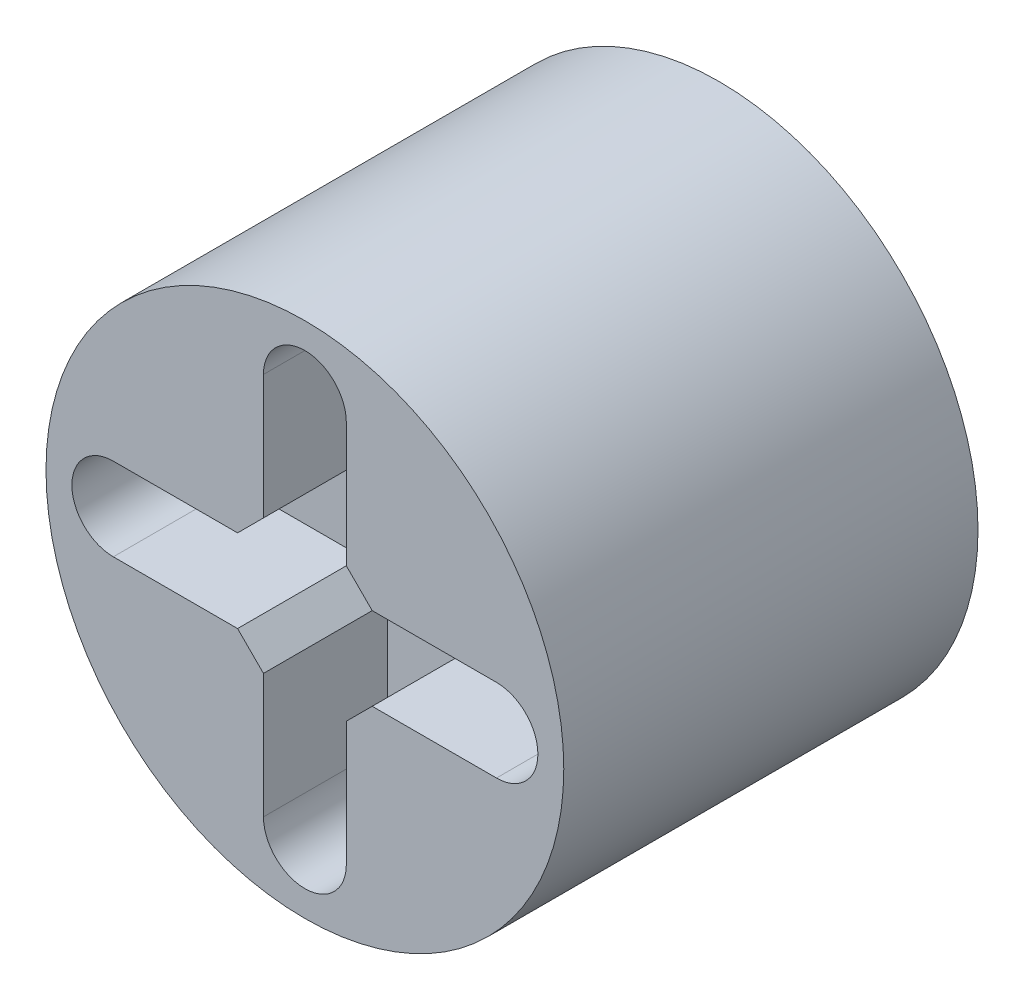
ISO-10303-21;
HEADER;
FILE_DESCRIPTION(('STEP AP214'),'2;1');
FILE_NAME('part.step','',(''),(''),'','','');
FILE_SCHEMA(('AUTOMOTIVE_DESIGN { 1 0 10303 214 1 1 1 1 }'));
ENDSEC;
DATA;
#1=APPLICATION_CONTEXT('core data for automotive mechanical design processes');
#2=APPLICATION_PROTOCOL_DEFINITION('international standard','automotive_design',2000,#1);
#3=PRODUCT_CONTEXT('',#1,'mechanical');
#4=PRODUCT('Part','Part','',(#3));
#5=PRODUCT_RELATED_PRODUCT_CATEGORY('part','',(#4));
#6=PRODUCT_DEFINITION_FORMATION('','',#4);
#7=PRODUCT_DEFINITION_CONTEXT('part definition',#1,'design');
#8=PRODUCT_DEFINITION('design','',#6,#7);
#9=PRODUCT_DEFINITION_SHAPE('','',#8);
#10=(LENGTH_UNIT() NAMED_UNIT(*) SI_UNIT(.MILLI.,.METRE.));
#11=(NAMED_UNIT(*) PLANE_ANGLE_UNIT() SI_UNIT($,.RADIAN.));
#12=(NAMED_UNIT(*) SI_UNIT($,.STERADIAN.) SOLID_ANGLE_UNIT());
#13=UNCERTAINTY_MEASURE_WITH_UNIT(LENGTH_MEASURE(1.E-05),#10,'distance_accuracy_value','');
#14=(GEOMETRIC_REPRESENTATION_CONTEXT(3) GLOBAL_UNCERTAINTY_ASSIGNED_CONTEXT((#13)) GLOBAL_UNIT_ASSIGNED_CONTEXT((#10,
#11,#12)) REPRESENTATION_CONTEXT('',''));
#15=CARTESIAN_POINT('',(0.,0.,0.));
#16=DIRECTION('',(0.,0.,1.));
#17=DIRECTION('',(1.,0.,0.));
#18=AXIS2_PLACEMENT_3D('',#15,#16,#17);
#19=CARTESIAN_POINT('',(0.,0.,20.));
#20=DIRECTION('',(0.,0.,1.));
#21=DIRECTION('',(1.,0.,0.));
#22=AXIS2_PLACEMENT_3D('',#19,#20,#21);
#23=PLANE('',#22);
#24=CARTESIAN_POINT('',(0.,0.,20.));
#25=DIRECTION('',(0.,0.,1.));
#26=DIRECTION('',(1.,0.,0.));
#27=AXIS2_PLACEMENT_3D('',#24,#25,#26);
#28=CIRCLE('',#27,12.5);
#29=CARTESIAN_POINT('',(12.5,0.,20.));
#30=VERTEX_POINT('',#29);
#31=EDGE_CURVE('E408',#30,#30,#28,.T.);
#32=ORIENTED_EDGE('',*,*,#31,.T.);
#33=EDGE_LOOP('',(#32));
#34=FACE_BOUND('',#33,.T.);
#35=DIRECTION('',(0.,-1.,0.));
#36=VECTOR('',#35,1.);
#37=CARTESIAN_POINT('',(-2.,0.,20.));
#38=LINE('',#37,#36);
#39=CARTESIAN_POINT('',(-2.,-3.25,20.));
#40=VERTEX_POINT('',#39);
#41=CARTESIAN_POINT('',(-2.,-9.25,20.));
#42=VERTEX_POINT('',#41);
#43=EDGE_CURVE('E396',#40,#42,#38,.T.);
#44=ORIENTED_EDGE('',*,*,#43,.F.);
#45=DIRECTION('',(0.707106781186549,-0.707106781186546,0.));
#46=VECTOR('',#45,1.);
#47=CARTESIAN_POINT('',(-2.625,-2.62500000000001,20.));
#48=LINE('',#47,#46);
#49=CARTESIAN_POINT('',(-3.25000000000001,-2.,20.));
#50=VERTEX_POINT('',#49);
#51=EDGE_CURVE('E494',#40,#50,#48,.F.);
#52=ORIENTED_EDGE('',*,*,#51,.T.);
#53=DIRECTION('',(1.,0.,0.));
#54=VECTOR('',#53,1.);
#55=CARTESIAN_POINT('',(0.,-2.,20.));
#56=LINE('',#55,#54);
#57=CARTESIAN_POINT('',(-9.25,-2.,20.));
#58=VERTEX_POINT('',#57);
#59=EDGE_CURVE('E392',#58,#50,#56,.T.);
#60=ORIENTED_EDGE('',*,*,#59,.F.);
#61=CARTESIAN_POINT('',(-9.25,0.,20.));
#62=DIRECTION('',(0.,0.,1.));
#63=DIRECTION('',(1.,0.,0.));
#64=AXIS2_PLACEMENT_3D('',#61,#62,#63);
#65=CIRCLE('',#64,2.);
#66=CARTESIAN_POINT('',(-9.25,2.,20.));
#67=VERTEX_POINT('',#66);
#68=EDGE_CURVE('E388',#67,#58,#65,.T.);
#69=ORIENTED_EDGE('',*,*,#68,.F.);
#70=DIRECTION('',(1.,0.,0.));
#71=VECTOR('',#70,1.);
#72=CARTESIAN_POINT('',(0.,2.,20.));
#73=LINE('',#72,#71);
#74=CARTESIAN_POINT('',(-3.25,2.,20.));
#75=VERTEX_POINT('',#74);
#76=EDGE_CURVE('E384',#67,#75,#73,.T.);
#77=ORIENTED_EDGE('',*,*,#76,.T.);
#78=DIRECTION('',(0.707106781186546,0.707106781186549,0.));
#79=VECTOR('',#78,1.);
#80=CARTESIAN_POINT('',(-2.62500000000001,2.625,20.));
#81=LINE('',#80,#79);
#82=CARTESIAN_POINT('',(-2.,3.25000000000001,20.));
#83=VERTEX_POINT('',#82);
#84=EDGE_CURVE('E485',#75,#83,#81,.T.);
#85=ORIENTED_EDGE('',*,*,#84,.T.);
#86=DIRECTION('',(0.,-1.,0.));
#87=VECTOR('',#86,1.);
#88=CARTESIAN_POINT('',(-2.,0.,20.));
#89=LINE('',#88,#87);
#90=CARTESIAN_POINT('',(-2.,9.25,20.));
#91=VERTEX_POINT('',#90);
#92=EDGE_CURVE('E381',#91,#83,#89,.T.);
#93=ORIENTED_EDGE('',*,*,#92,.F.);
#94=CARTESIAN_POINT('',(0.,9.25,20.));
#95=DIRECTION('',(0.,0.,1.));
#96=DIRECTION('',(1.,0.,0.));
#97=AXIS2_PLACEMENT_3D('',#94,#95,#96);
#98=CIRCLE('',#97,2.);
#99=CARTESIAN_POINT('',(2.,9.25,20.));
#100=VERTEX_POINT('',#99);
#101=EDGE_CURVE('E377',#91,#100,#98,.F.);
#102=ORIENTED_EDGE('',*,*,#101,.T.);
#103=DIRECTION('',(0.,-1.,0.));
#104=VECTOR('',#103,1.);
#105=CARTESIAN_POINT('',(2.,0.,20.));
#106=LINE('',#105,#104);
#107=CARTESIAN_POINT('',(2.,3.25,20.));
#108=VERTEX_POINT('',#107);
#109=EDGE_CURVE('E373',#100,#108,#106,.T.);
#110=ORIENTED_EDGE('',*,*,#109,.T.);
#111=DIRECTION('',(-0.707106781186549,0.707106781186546,0.));
#112=VECTOR('',#111,1.);
#113=CARTESIAN_POINT('',(2.625,2.62500000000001,20.));
#114=LINE('',#113,#112);
#115=CARTESIAN_POINT('',(3.25000000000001,2.,20.));
#116=VERTEX_POINT('',#115);
#117=EDGE_CURVE('E488',#108,#116,#114,.F.);
#118=ORIENTED_EDGE('',*,*,#117,.T.);
#119=DIRECTION('',(1.,0.,0.));
#120=VECTOR('',#119,1.);
#121=CARTESIAN_POINT('',(0.,2.,20.));
#122=LINE('',#121,#120);
#123=CARTESIAN_POINT('',(9.25,2.,20.));
#124=VERTEX_POINT('',#123);
#125=EDGE_CURVE('E370',#116,#124,#122,.T.);
#126=ORIENTED_EDGE('',*,*,#125,.T.);
#127=CARTESIAN_POINT('',(9.25,0.,20.));
#128=DIRECTION('',(0.,0.,1.));
#129=DIRECTION('',(1.,0.,0.));
#130=AXIS2_PLACEMENT_3D('',#127,#128,#129);
#131=CIRCLE('',#130,2.);
#132=CARTESIAN_POINT('',(9.25,-2.,20.));
#133=VERTEX_POINT('',#132);
#134=EDGE_CURVE('E322',#124,#133,#131,.F.);
#135=ORIENTED_EDGE('',*,*,#134,.T.);
#136=DIRECTION('',(1.,0.,0.));
#137=VECTOR('',#136,1.);
#138=CARTESIAN_POINT('',(0.,-2.,20.));
#139=LINE('',#138,#137);
#140=CARTESIAN_POINT('',(3.25000000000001,-2.,20.));
#141=VERTEX_POINT('',#140);
#142=EDGE_CURVE('E330',#141,#133,#139,.T.);
#143=ORIENTED_EDGE('',*,*,#142,.F.);
#144=DIRECTION('',(-0.707106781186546,-0.707106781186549,0.));
#145=VECTOR('',#144,1.);
#146=CARTESIAN_POINT('',(2.62500000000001,-2.625,20.));
#147=LINE('',#146,#145);
#148=CARTESIAN_POINT('',(2.,-3.25000000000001,20.));
#149=VERTEX_POINT('',#148);
#150=EDGE_CURVE('E491',#141,#149,#147,.T.);
#151=ORIENTED_EDGE('',*,*,#150,.T.);
#152=DIRECTION('',(0.,-1.,0.));
#153=VECTOR('',#152,1.);
#154=CARTESIAN_POINT('',(2.,0.,20.));
#155=LINE('',#154,#153);
#156=CARTESIAN_POINT('',(2.,-9.25,20.));
#157=VERTEX_POINT('',#156);
#158=EDGE_CURVE('E333',#149,#157,#155,.T.);
#159=ORIENTED_EDGE('',*,*,#158,.T.);
#160=CARTESIAN_POINT('',(0.,-9.25,20.));
#161=DIRECTION('',(0.,0.,1.));
#162=DIRECTION('',(1.,0.,0.));
#163=AXIS2_PLACEMENT_3D('',#160,#161,#162);
#164=CIRCLE('',#163,2.);
#165=EDGE_CURVE('E399',#42,#157,#164,.T.);
#166=ORIENTED_EDGE('',*,*,#165,.F.);
#167=EDGE_LOOP('',(#44,#52,#60,#69,#77,#85,#93,#102,#110,#118,#126,#135,#143,#151,#159,#166));
#168=FACE_BOUND('',#167,.T.);
#169=ADVANCED_FACE('F162',(#34,#168),#23,.T.);
#170=CARTESIAN_POINT('',(0.,0.,0.));
#171=DIRECTION('',(0.,0.,1.));
#172=DIRECTION('',(1.,0.,0.));
#173=AXIS2_PLACEMENT_3D('',#170,#171,#172);
#174=PLANE('',#173);
#175=CARTESIAN_POINT('',(0.,0.,0.));
#176=DIRECTION('',(0.,0.,1.));
#177=DIRECTION('',(1.,0.,0.));
#178=AXIS2_PLACEMENT_3D('',#175,#176,#177);
#179=CIRCLE('',#178,12.5);
#180=CARTESIAN_POINT('',(12.5,0.,0.));
#181=VERTEX_POINT('',#180);
#182=EDGE_CURVE('E477',#181,#181,#179,.T.);
#183=ORIENTED_EDGE('',*,*,#182,.F.);
#184=EDGE_LOOP('',(#183));
#185=FACE_BOUND('',#184,.T.);
#186=DIRECTION('',(0.,-1.,0.));
#187=VECTOR('',#186,1.);
#188=CARTESIAN_POINT('',(-5.,5.,0.));
#189=LINE('',#188,#187);
#190=CARTESIAN_POINT('',(-5.,5.,0.));
#191=VERTEX_POINT('',#190);
#192=CARTESIAN_POINT('',(-5.,-5.,0.));
#193=VERTEX_POINT('',#192);
#194=EDGE_CURVE('E431',#191,#193,#189,.T.);
#195=ORIENTED_EDGE('',*,*,#194,.T.);
#196=DIRECTION('',(1.,0.,0.));
#197=VECTOR('',#196,1.);
#198=CARTESIAN_POINT('',(5.,-5.,0.));
#199=LINE('',#198,#197);
#200=CARTESIAN_POINT('',(5.,-5.,0.));
#201=VERTEX_POINT('',#200);
#202=EDGE_CURVE('E453',#193,#201,#199,.T.);
#203=ORIENTED_EDGE('',*,*,#202,.T.);
#204=DIRECTION('',(0.,1.,0.));
#205=VECTOR('',#204,1.);
#206=CARTESIAN_POINT('',(5.,5.,0.));
#207=LINE('',#206,#205);
#208=CARTESIAN_POINT('',(5.,5.,0.));
#209=VERTEX_POINT('',#208);
#210=EDGE_CURVE('E457',#201,#209,#207,.T.);
#211=ORIENTED_EDGE('',*,*,#210,.T.);
#212=DIRECTION('',(-1.,0.,0.));
#213=VECTOR('',#212,1.);
#214=CARTESIAN_POINT('',(5.,5.,0.));
#215=LINE('',#214,#213);
#216=EDGE_CURVE('E437',#209,#191,#215,.T.);
#217=ORIENTED_EDGE('',*,*,#216,.T.);
#218=EDGE_LOOP('',(#195,#203,#211,#217));
#219=FACE_BOUND('',#218,.T.);
#220=ADVANCED_FACE('F589',(#185,#219),#174,.F.);
#221=CARTESIAN_POINT('',(0.,0.,10.));
#222=DIRECTION('',(0.,0.,-1.));
#223=DIRECTION('',(-1.,0.,0.));
#224=AXIS2_PLACEMENT_3D('',#221,#222,#223);
#225=CYLINDRICAL_SURFACE('',#224,12.5);
#226=ORIENTED_EDGE('',*,*,#182,.T.);
#227=EDGE_LOOP('',(#226));
#228=FACE_BOUND('',#227,.T.);
#229=ORIENTED_EDGE('',*,*,#31,.F.);
#230=EDGE_LOOP('',(#229));
#231=FACE_BOUND('',#230,.T.);
#232=ADVANCED_FACE('F595',(#228,#231),#225,.T.);
#233=CARTESIAN_POINT('',(-5.,5.,10.));
#234=DIRECTION('',(1.,0.,0.));
#235=DIRECTION('',(0.,1.,0.));
#236=AXIS2_PLACEMENT_3D('',#233,#234,#235);
#237=PLANE('',#236);
#238=ORIENTED_EDGE('',*,*,#194,.F.);
#239=DIRECTION('',(0.,0.,-1.));
#240=VECTOR('',#239,1.);
#241=CARTESIAN_POINT('',(-5.,5.,10.));
#242=LINE('',#241,#240);
#243=CARTESIAN_POINT('',(-5.,5.,10.));
#244=VERTEX_POINT('',#243);
#245=EDGE_CURVE('E449',#244,#191,#242,.T.);
#246=ORIENTED_EDGE('',*,*,#245,.F.);
#247=DIRECTION('',(0.,-1.,0.));
#248=VECTOR('',#247,1.);
#249=CARTESIAN_POINT('',(-5.,5.,10.));
#250=LINE('',#249,#248);
#251=CARTESIAN_POINT('',(-5.,-5.,10.));
#252=VERTEX_POINT('',#251);
#253=EDGE_CURVE('E432',#244,#252,#250,.T.);
#254=ORIENTED_EDGE('',*,*,#253,.T.);
#255=DIRECTION('',(0.,0.,-1.));
#256=VECTOR('',#255,1.);
#257=CARTESIAN_POINT('',(-5.,-5.,10.));
#258=LINE('',#257,#256);
#259=EDGE_CURVE('E473',#252,#193,#258,.T.);
#260=ORIENTED_EDGE('',*,*,#259,.T.);
#261=EDGE_LOOP('',(#238,#246,#254,#260));
#262=FACE_BOUND('',#261,.T.);
#263=ADVANCED_FACE('F615',(#262),#237,.T.);
#264=CARTESIAN_POINT('',(5.,-5.,10.));
#265=DIRECTION('',(0.,1.,0.));
#266=DIRECTION('',(-1.,0.,0.));
#267=AXIS2_PLACEMENT_3D('',#264,#265,#266);
#268=PLANE('',#267);
#269=ORIENTED_EDGE('',*,*,#202,.F.);
#270=ORIENTED_EDGE('',*,*,#259,.F.);
#271=DIRECTION('',(1.,0.,0.));
#272=VECTOR('',#271,1.);
#273=CARTESIAN_POINT('',(5.,-5.,10.));
#274=LINE('',#273,#272);
#275=CARTESIAN_POINT('',(5.,-5.,10.));
#276=VERTEX_POINT('',#275);
#277=EDGE_CURVE('E436',#252,#276,#274,.T.);
#278=ORIENTED_EDGE('',*,*,#277,.T.);
#279=DIRECTION('',(0.,0.,-1.));
#280=VECTOR('',#279,1.);
#281=CARTESIAN_POINT('',(5.,-5.,10.));
#282=LINE('',#281,#280);
#283=EDGE_CURVE('E470',#276,#201,#282,.T.);
#284=ORIENTED_EDGE('',*,*,#283,.T.);
#285=EDGE_LOOP('',(#269,#270,#278,#284));
#286=FACE_BOUND('',#285,.T.);
#287=ADVANCED_FACE('F611',(#286),#268,.T.);
#288=CARTESIAN_POINT('',(5.,5.,10.));
#289=DIRECTION('',(-1.,0.,0.));
#290=DIRECTION('',(0.,-1.,0.));
#291=AXIS2_PLACEMENT_3D('',#288,#289,#290);
#292=PLANE('',#291);
#293=ORIENTED_EDGE('',*,*,#210,.F.);
#294=ORIENTED_EDGE('',*,*,#283,.F.);
#295=DIRECTION('',(0.,1.,0.));
#296=VECTOR('',#295,1.);
#297=CARTESIAN_POINT('',(5.,5.,10.));
#298=LINE('',#297,#296);
#299=CARTESIAN_POINT('',(5.,5.,10.));
#300=VERTEX_POINT('',#299);
#301=EDGE_CURVE('E441',#276,#300,#298,.T.);
#302=ORIENTED_EDGE('',*,*,#301,.T.);
#303=DIRECTION('',(0.,0.,-1.));
#304=VECTOR('',#303,1.);
#305=CARTESIAN_POINT('',(5.,5.,10.));
#306=LINE('',#305,#304);
#307=EDGE_CURVE('E467',#300,#209,#306,.T.);
#308=ORIENTED_EDGE('',*,*,#307,.T.);
#309=EDGE_LOOP('',(#293,#294,#302,#308));
#310=FACE_BOUND('',#309,.T.);
#311=ADVANCED_FACE('F607',(#310),#292,.T.);
#312=CARTESIAN_POINT('',(5.,5.,10.));
#313=DIRECTION('',(0.,-1.,0.));
#314=DIRECTION('',(1.,0.,0.));
#315=AXIS2_PLACEMENT_3D('',#312,#313,#314);
#316=PLANE('',#315);
#317=ORIENTED_EDGE('',*,*,#216,.F.);
#318=ORIENTED_EDGE('',*,*,#307,.F.);
#319=DIRECTION('',(-1.,0.,0.));
#320=VECTOR('',#319,1.);
#321=CARTESIAN_POINT('',(5.,5.,10.));
#322=LINE('',#321,#320);
#323=EDGE_CURVE('E445',#300,#244,#322,.T.);
#324=ORIENTED_EDGE('',*,*,#323,.T.);
#325=ORIENTED_EDGE('',*,*,#245,.T.);
#326=EDGE_LOOP('',(#317,#318,#324,#325));
#327=FACE_BOUND('',#326,.T.);
#328=ADVANCED_FACE('F603',(#327),#316,.T.);
#329=CARTESIAN_POINT('',(0.,0.,10.));
#330=DIRECTION('',(0.,0.,1.));
#331=DIRECTION('',(1.,0.,0.));
#332=AXIS2_PLACEMENT_3D('',#329,#330,#331);
#333=PLANE('',#332);
#334=ORIENTED_EDGE('',*,*,#277,.F.);
#335=ORIENTED_EDGE('',*,*,#253,.F.);
#336=ORIENTED_EDGE('',*,*,#323,.F.);
#337=ORIENTED_EDGE('',*,*,#301,.F.);
#338=EDGE_LOOP('',(#334,#335,#336,#337));
#339=FACE_BOUND('',#338,.T.);
#340=ADVANCED_FACE('F586',(#339),#333,.F.);
#341=CARTESIAN_POINT('',(0.,-2.,14.));
#342=DIRECTION('',(0.,-1.,0.));
#343=DIRECTION('',(1.,0.,0.));
#344=AXIS2_PLACEMENT_3D('',#341,#342,#343);
#345=PLANE('',#344);
#346=DIRECTION('',(1.,0.,0.));
#347=VECTOR('',#346,1.);
#348=CARTESIAN_POINT('',(0.,-2.,14.));
#349=LINE('',#348,#347);
#350=CARTESIAN_POINT('',(3.25000000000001,-2.,14.));
#351=VERTEX_POINT('',#350);
#352=CARTESIAN_POINT('',(9.25,-2.,14.));
#353=VERTEX_POINT('',#352);
#354=EDGE_CURVE('E325',#351,#353,#349,.T.);
#355=ORIENTED_EDGE('',*,*,#354,.F.);
#356=DIRECTION('',(0.,0.,1.));
#357=VECTOR('',#356,1.);
#358=CARTESIAN_POINT('',(3.25000000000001,-2.,20.));
#359=LINE('',#358,#357);
#360=EDGE_CURVE('E500',#351,#141,#359,.T.);
#361=ORIENTED_EDGE('',*,*,#360,.T.);
#362=ORIENTED_EDGE('',*,*,#142,.T.);
#363=DIRECTION('',(0.,0.,1.));
#364=VECTOR('',#363,1.);
#365=CARTESIAN_POINT('',(9.25,-2.,14.));
#366=LINE('',#365,#364);
#367=EDGE_CURVE('E405',#353,#133,#366,.T.);
#368=ORIENTED_EDGE('',*,*,#367,.F.);
#369=EDGE_LOOP('',(#355,#361,#362,#368));
#370=FACE_BOUND('',#369,.T.);
#371=ADVANCED_FACE('F577',(#370),#345,.F.);
#372=CARTESIAN_POINT('',(2.,0.,14.));
#373=DIRECTION('',(-1.,0.,0.));
#374=DIRECTION('',(0.,0.,1.));
#375=AXIS2_PLACEMENT_3D('',#372,#373,#374);
#376=PLANE('',#375);
#377=ORIENTED_EDGE('',*,*,#158,.F.);
#378=DIRECTION('',(0.,0.,-1.));
#379=VECTOR('',#378,1.);
#380=CARTESIAN_POINT('',(2.,-3.25000000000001,14.));
#381=LINE('',#380,#379);
#382=CARTESIAN_POINT('',(2.,-3.25000000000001,14.));
#383=VERTEX_POINT('',#382);
#384=EDGE_CURVE('E504',#149,#383,#381,.T.);
#385=ORIENTED_EDGE('',*,*,#384,.T.);
#386=DIRECTION('',(0.,-1.,0.));
#387=VECTOR('',#386,1.);
#388=CARTESIAN_POINT('',(2.,0.,14.));
#389=LINE('',#388,#387);
#390=CARTESIAN_POINT('',(2.,-9.25,14.));
#391=VERTEX_POINT('',#390);
#392=EDGE_CURVE('E363',#383,#391,#389,.T.);
#393=ORIENTED_EDGE('',*,*,#392,.T.);
#394=DIRECTION('',(0.,0.,1.));
#395=VECTOR('',#394,1.);
#396=CARTESIAN_POINT('',(2.,-9.25,14.));
#397=LINE('',#396,#395);
#398=EDGE_CURVE('E409',#391,#157,#397,.T.);
#399=ORIENTED_EDGE('',*,*,#398,.T.);
#400=EDGE_LOOP('',(#377,#385,#393,#399));
#401=FACE_BOUND('',#400,.T.);
#402=ADVANCED_FACE('F578',(#401),#376,.T.);
#403=CARTESIAN_POINT('',(0.,-9.25,14.));
#404=DIRECTION('',(0.,0.,1.));
#405=DIRECTION('',(1.,0.,0.));
#406=AXIS2_PLACEMENT_3D('',#403,#404,#405);
#407=CYLINDRICAL_SURFACE('',#406,2.);
#408=ORIENTED_EDGE('',*,*,#165,.T.);
#409=ORIENTED_EDGE('',*,*,#398,.F.);
#410=CARTESIAN_POINT('',(0.,-9.25,14.));
#411=DIRECTION('',(0.,0.,1.));
#412=DIRECTION('',(1.,0.,0.));
#413=AXIS2_PLACEMENT_3D('',#410,#411,#412);
#414=CIRCLE('',#413,2.);
#415=CARTESIAN_POINT('',(-2.,-9.25,14.));
#416=VERTEX_POINT('',#415);
#417=EDGE_CURVE('E359',#416,#391,#414,.T.);
#418=ORIENTED_EDGE('',*,*,#417,.F.);
#419=DIRECTION('',(0.,0.,1.));
#420=VECTOR('',#419,1.);
#421=CARTESIAN_POINT('',(-2.,-9.25,14.));
#422=LINE('',#421,#420);
#423=EDGE_CURVE('E413',#416,#42,#422,.T.);
#424=ORIENTED_EDGE('',*,*,#423,.T.);
#425=EDGE_LOOP('',(#408,#409,#418,#424));
#426=FACE_BOUND('',#425,.T.);
#427=ADVANCED_FACE('F566',(#426),#407,.F.);
#428=CARTESIAN_POINT('',(-2.,0.,14.));
#429=DIRECTION('',(-1.,0.,0.));
#430=DIRECTION('',(0.,-1.,0.));
#431=AXIS2_PLACEMENT_3D('',#428,#429,#430);
#432=PLANE('',#431);
#433=DIRECTION('',(0.,-1.,0.));
#434=VECTOR('',#433,1.);
#435=CARTESIAN_POINT('',(-2.,0.,14.));
#436=LINE('',#435,#434);
#437=CARTESIAN_POINT('',(-2.,-3.25,14.));
#438=VERTEX_POINT('',#437);
#439=EDGE_CURVE('E356',#438,#416,#436,.T.);
#440=ORIENTED_EDGE('',*,*,#439,.F.);
#441=DIRECTION('',(0.,0.,1.));
#442=VECTOR('',#441,1.);
#443=CARTESIAN_POINT('',(-2.,-3.25,14.));
#444=LINE('',#443,#442);
#445=EDGE_CURVE('E481',#438,#40,#444,.T.);
#446=ORIENTED_EDGE('',*,*,#445,.T.);
#447=ORIENTED_EDGE('',*,*,#43,.T.);
#448=ORIENTED_EDGE('',*,*,#423,.F.);
#449=EDGE_LOOP('',(#440,#446,#447,#448));
#450=FACE_BOUND('',#449,.T.);
#451=ADVANCED_FACE('F560',(#450),#432,.F.);
#452=CARTESIAN_POINT('',(0.,-2.,14.));
#453=DIRECTION('',(0.,-1.,0.));
#454=DIRECTION('',(1.,0.,0.));
#455=AXIS2_PLACEMENT_3D('',#452,#453,#454);
#456=PLANE('',#455);
#457=ORIENTED_EDGE('',*,*,#59,.T.);
#458=DIRECTION('',(0.,0.,-1.));
#459=VECTOR('',#458,1.);
#460=CARTESIAN_POINT('',(-3.25000000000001,-2.,14.));
#461=LINE('',#460,#459);
#462=CARTESIAN_POINT('',(-3.25000000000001,-2.,14.));
#463=VERTEX_POINT('',#462);
#464=EDGE_CURVE('E497',#50,#463,#461,.T.);
#465=ORIENTED_EDGE('',*,*,#464,.T.);
#466=DIRECTION('',(1.,0.,0.));
#467=VECTOR('',#466,1.);
#468=CARTESIAN_POINT('',(0.,-2.,14.));
#469=LINE('',#468,#467);
#470=CARTESIAN_POINT('',(-9.25,-2.,14.));
#471=VERTEX_POINT('',#470);
#472=EDGE_CURVE('E352',#471,#463,#469,.T.);
#473=ORIENTED_EDGE('',*,*,#472,.F.);
#474=DIRECTION('',(0.,0.,1.));
#475=VECTOR('',#474,1.);
#476=CARTESIAN_POINT('',(-9.25,-2.,14.));
#477=LINE('',#476,#475);
#478=EDGE_CURVE('E417',#471,#58,#477,.T.);
#479=ORIENTED_EDGE('',*,*,#478,.T.);
#480=EDGE_LOOP('',(#457,#465,#473,#479));
#481=FACE_BOUND('',#480,.T.);
#482=ADVANCED_FACE('F716',(#481),#456,.F.);
#483=CARTESIAN_POINT('',(-9.25,0.,14.));
#484=DIRECTION('',(0.,0.,1.));
#485=DIRECTION('',(1.,0.,0.));
#486=AXIS2_PLACEMENT_3D('',#483,#484,#485);
#487=CYLINDRICAL_SURFACE('',#486,2.);
#488=ORIENTED_EDGE('',*,*,#68,.T.);
#489=ORIENTED_EDGE('',*,*,#478,.F.);
#490=CARTESIAN_POINT('',(-9.25,0.,14.));
#491=DIRECTION('',(0.,0.,1.));
#492=DIRECTION('',(1.,0.,0.));
#493=AXIS2_PLACEMENT_3D('',#490,#491,#492);
#494=CIRCLE('',#493,2.);
#495=CARTESIAN_POINT('',(-9.25,2.,14.));
#496=VERTEX_POINT('',#495);
#497=EDGE_CURVE('E348',#496,#471,#494,.T.);
#498=ORIENTED_EDGE('',*,*,#497,.F.);
#499=DIRECTION('',(0.,0.,1.));
#500=VECTOR('',#499,1.);
#501=CARTESIAN_POINT('',(-9.25,2.,14.));
#502=LINE('',#501,#500);
#503=EDGE_CURVE('E420',#496,#67,#502,.T.);
#504=ORIENTED_EDGE('',*,*,#503,.T.);
#505=EDGE_LOOP('',(#488,#489,#498,#504));
#506=FACE_BOUND('',#505,.T.);
#507=ADVANCED_FACE('F549',(#506),#487,.F.);
#508=CARTESIAN_POINT('',(0.,2.,14.));
#509=DIRECTION('',(0.,-1.,0.));
#510=DIRECTION('',(0.,0.,-1.));
#511=AXIS2_PLACEMENT_3D('',#508,#509,#510);
#512=PLANE('',#511);
#513=DIRECTION('',(1.,0.,0.));
#514=VECTOR('',#513,1.);
#515=CARTESIAN_POINT('',(0.,2.,14.));
#516=LINE('',#515,#514);
#517=CARTESIAN_POINT('',(-3.25,2.,14.));
#518=VERTEX_POINT('',#517);
#519=EDGE_CURVE('E345',#496,#518,#516,.T.);
#520=ORIENTED_EDGE('',*,*,#519,.T.);
#521=DIRECTION('',(0.,0.,1.));
#522=VECTOR('',#521,1.);
#523=CARTESIAN_POINT('',(-3.25,2.,20.));
#524=LINE('',#523,#522);
#525=EDGE_CURVE('E513',#518,#75,#524,.T.);
#526=ORIENTED_EDGE('',*,*,#525,.T.);
#527=ORIENTED_EDGE('',*,*,#76,.F.);
#528=ORIENTED_EDGE('',*,*,#503,.F.);
#529=EDGE_LOOP('',(#520,#526,#527,#528));
#530=FACE_BOUND('',#529,.T.);
#531=ADVANCED_FACE('F545',(#530),#512,.T.);
#532=CARTESIAN_POINT('',(-2.,0.,14.));
#533=DIRECTION('',(-1.,0.,0.));
#534=DIRECTION('',(0.,0.,1.));
#535=AXIS2_PLACEMENT_3D('',#532,#533,#534);
#536=PLANE('',#535);
#537=ORIENTED_EDGE('',*,*,#92,.T.);
#538=DIRECTION('',(0.,0.,-1.));
#539=VECTOR('',#538,1.);
#540=CARTESIAN_POINT('',(-2.,3.25000000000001,14.));
#541=LINE('',#540,#539);
#542=CARTESIAN_POINT('',(-2.,3.25000000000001,14.));
#543=VERTEX_POINT('',#542);
#544=EDGE_CURVE('E179',#83,#543,#541,.T.);
#545=ORIENTED_EDGE('',*,*,#544,.T.);
#546=DIRECTION('',(0.,-1.,0.));
#547=VECTOR('',#546,1.);
#548=CARTESIAN_POINT('',(-2.,0.,14.));
#549=LINE('',#548,#547);
#550=CARTESIAN_POINT('',(-2.,9.25,14.));
#551=VERTEX_POINT('',#550);
#552=EDGE_CURVE('E342',#551,#543,#549,.T.);
#553=ORIENTED_EDGE('',*,*,#552,.F.);
#554=DIRECTION('',(0.,0.,1.));
#555=VECTOR('',#554,1.);
#556=CARTESIAN_POINT('',(-2.,9.25,14.));
#557=LINE('',#556,#555);
#558=EDGE_CURVE('E423',#551,#91,#557,.T.);
#559=ORIENTED_EDGE('',*,*,#558,.T.);
#560=EDGE_LOOP('',(#537,#545,#553,#559));
#561=FACE_BOUND('',#560,.T.);
#562=ADVANCED_FACE('F540',(#561),#536,.F.);
#563=CARTESIAN_POINT('',(0.,9.25,14.));
#564=DIRECTION('',(0.,0.,1.));
#565=DIRECTION('',(1.,0.,0.));
#566=AXIS2_PLACEMENT_3D('',#563,#564,#565);
#567=CYLINDRICAL_SURFACE('',#566,2.);
#568=ORIENTED_EDGE('',*,*,#101,.F.);
#569=ORIENTED_EDGE('',*,*,#558,.F.);
#570=CARTESIAN_POINT('',(0.,9.25,14.));
#571=DIRECTION('',(0.,0.,1.));
#572=DIRECTION('',(1.,0.,0.));
#573=AXIS2_PLACEMENT_3D('',#570,#571,#572);
#574=CIRCLE('',#573,2.);
#575=CARTESIAN_POINT('',(2.,9.25,14.));
#576=VERTEX_POINT('',#575);
#577=EDGE_CURVE('E339',#551,#576,#574,.F.);
#578=ORIENTED_EDGE('',*,*,#577,.T.);
#579=DIRECTION('',(0.,0.,1.));
#580=VECTOR('',#579,1.);
#581=CARTESIAN_POINT('',(2.,9.25,14.));
#582=LINE('',#581,#580);
#583=EDGE_CURVE('E324',#576,#100,#582,.T.);
#584=ORIENTED_EDGE('',*,*,#583,.T.);
#585=EDGE_LOOP('',(#568,#569,#578,#584));
#586=FACE_BOUND('',#585,.T.);
#587=ADVANCED_FACE('F539',(#586),#567,.F.);
#588=CARTESIAN_POINT('',(2.,0.,14.));
#589=DIRECTION('',(-1.,0.,0.));
#590=DIRECTION('',(0.,0.,1.));
#591=AXIS2_PLACEMENT_3D('',#588,#589,#590);
#592=PLANE('',#591);
#593=DIRECTION('',(0.,-1.,0.));
#594=VECTOR('',#593,1.);
#595=CARTESIAN_POINT('',(2.,0.,14.));
#596=LINE('',#595,#594);
#597=CARTESIAN_POINT('',(2.,3.25,14.));
#598=VERTEX_POINT('',#597);
#599=EDGE_CURVE('E313',#576,#598,#596,.T.);
#600=ORIENTED_EDGE('',*,*,#599,.T.);
#601=DIRECTION('',(0.,0.,1.));
#602=VECTOR('',#601,1.);
#603=CARTESIAN_POINT('',(2.,3.25,14.));
#604=LINE('',#603,#602);
#605=EDGE_CURVE('E507',#598,#108,#604,.T.);
#606=ORIENTED_EDGE('',*,*,#605,.T.);
#607=ORIENTED_EDGE('',*,*,#109,.F.);
#608=ORIENTED_EDGE('',*,*,#583,.F.);
#609=EDGE_LOOP('',(#600,#606,#607,#608));
#610=FACE_BOUND('',#609,.T.);
#611=ADVANCED_FACE('F531',(#610),#592,.T.);
#612=CARTESIAN_POINT('',(0.,2.,14.));
#613=DIRECTION('',(0.,-1.,0.));
#614=DIRECTION('',(0.,0.,-1.));
#615=AXIS2_PLACEMENT_3D('',#612,#613,#614);
#616=PLANE('',#615);
#617=ORIENTED_EDGE('',*,*,#125,.F.);
#618=DIRECTION('',(0.,0.,-1.));
#619=VECTOR('',#618,1.);
#620=CARTESIAN_POINT('',(3.25000000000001,2.,14.));
#621=LINE('',#620,#619);
#622=CARTESIAN_POINT('',(3.25000000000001,2.,14.));
#623=VERTEX_POINT('',#622);
#624=EDGE_CURVE('E309',#116,#623,#621,.T.);
#625=ORIENTED_EDGE('',*,*,#624,.T.);
#626=DIRECTION('',(1.,0.,0.));
#627=VECTOR('',#626,1.);
#628=CARTESIAN_POINT('',(0.,2.,14.));
#629=LINE('',#628,#627);
#630=CARTESIAN_POINT('',(9.25,2.,14.));
#631=VERTEX_POINT('',#630);
#632=EDGE_CURVE('E302',#623,#631,#629,.T.);
#633=ORIENTED_EDGE('',*,*,#632,.T.);
#634=DIRECTION('',(0.,0.,1.));
#635=VECTOR('',#634,1.);
#636=CARTESIAN_POINT('',(9.25,2.,14.));
#637=LINE('',#636,#635);
#638=EDGE_CURVE('E306',#631,#124,#637,.T.);
#639=ORIENTED_EDGE('',*,*,#638,.T.);
#640=EDGE_LOOP('',(#617,#625,#633,#639));
#641=FACE_BOUND('',#640,.T.);
#642=ADVANCED_FACE('F305',(#641),#616,.T.);
#643=CARTESIAN_POINT('',(9.25,0.,14.));
#644=DIRECTION('',(0.,0.,1.));
#645=DIRECTION('',(1.,0.,0.));
#646=AXIS2_PLACEMENT_3D('',#643,#644,#645);
#647=CYLINDRICAL_SURFACE('',#646,2.);
#648=ORIENTED_EDGE('',*,*,#134,.F.);
#649=ORIENTED_EDGE('',*,*,#638,.F.);
#650=CARTESIAN_POINT('',(9.25,0.,14.));
#651=DIRECTION('',(0.,0.,1.));
#652=DIRECTION('',(1.,0.,0.));
#653=AXIS2_PLACEMENT_3D('',#650,#651,#652);
#654=CIRCLE('',#653,2.);
#655=EDGE_CURVE('E314',#631,#353,#654,.F.);
#656=ORIENTED_EDGE('',*,*,#655,.T.);
#657=ORIENTED_EDGE('',*,*,#367,.T.);
#658=EDGE_LOOP('',(#648,#649,#656,#657));
#659=FACE_BOUND('',#658,.T.);
#660=ADVANCED_FACE('F318',(#659),#647,.F.);
#661=CARTESIAN_POINT('',(0.,0.,14.));
#662=DIRECTION('',(0.,0.,1.));
#663=DIRECTION('',(1.,0.,0.));
#664=AXIS2_PLACEMENT_3D('',#661,#662,#663);
#665=PLANE('',#664);
#666=ORIENTED_EDGE('',*,*,#655,.F.);
#667=ORIENTED_EDGE('',*,*,#632,.F.);
#668=DIRECTION('',(0.707106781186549,-0.707106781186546,0.));
#669=VECTOR('',#668,1.);
#670=CARTESIAN_POINT('',(2.,3.25,14.));
#671=LINE('',#670,#669);
#672=EDGE_CURVE('E172',#623,#598,#671,.F.);
#673=ORIENTED_EDGE('',*,*,#672,.T.);
#674=ORIENTED_EDGE('',*,*,#599,.F.);
#675=ORIENTED_EDGE('',*,*,#577,.F.);
#676=ORIENTED_EDGE('',*,*,#552,.T.);
#677=DIRECTION('',(-0.707106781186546,-0.707106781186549,0.));
#678=VECTOR('',#677,1.);
#679=CARTESIAN_POINT('',(-3.25,2.,14.));
#680=LINE('',#679,#678);
#681=EDGE_CURVE('E12',#543,#518,#680,.T.);
#682=ORIENTED_EDGE('',*,*,#681,.T.);
#683=ORIENTED_EDGE('',*,*,#519,.F.);
#684=ORIENTED_EDGE('',*,*,#497,.T.);
#685=ORIENTED_EDGE('',*,*,#472,.T.);
#686=DIRECTION('',(-0.707106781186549,0.707106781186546,0.));
#687=VECTOR('',#686,1.);
#688=CARTESIAN_POINT('',(-2.,-3.25,14.));
#689=LINE('',#688,#687);
#690=EDGE_CURVE('E519',#463,#438,#689,.F.);
#691=ORIENTED_EDGE('',*,*,#690,.T.);
#692=ORIENTED_EDGE('',*,*,#439,.T.);
#693=ORIENTED_EDGE('',*,*,#417,.T.);
#694=ORIENTED_EDGE('',*,*,#392,.F.);
#695=DIRECTION('',(0.707106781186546,0.707106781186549,0.));
#696=VECTOR('',#695,1.);
#697=CARTESIAN_POINT('',(3.25000000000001,-2.,14.));
#698=LINE('',#697,#696);
#699=EDGE_CURVE('E522',#383,#351,#698,.T.);
#700=ORIENTED_EDGE('',*,*,#699,.T.);
#701=ORIENTED_EDGE('',*,*,#354,.T.);
#702=EDGE_LOOP('',(#666,#667,#673,#674,#675,#676,#682,#683,#684,#685,#691,#692,#693,#694,#700,#701));
#703=FACE_BOUND('',#702,.T.);
#704=ADVANCED_FACE('F327',(#703),#665,.T.);
#705=CARTESIAN_POINT('',(-2.,-3.25,14.));
#706=DIRECTION('',(-0.707106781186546,-0.707106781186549,0.));
#707=DIRECTION('',(0.,0.,1.));
#708=AXIS2_PLACEMENT_3D('',#705,#706,#707);
#709=PLANE('',#708);
#710=ORIENTED_EDGE('',*,*,#690,.F.);
#711=ORIENTED_EDGE('',*,*,#464,.F.);
#712=ORIENTED_EDGE('',*,*,#51,.F.);
#713=ORIENTED_EDGE('',*,*,#445,.F.);
#714=EDGE_LOOP('',(#710,#711,#712,#713));
#715=FACE_BOUND('',#714,.T.);
#716=ADVANCED_FACE('F558',(#715),#709,.F.);
#717=CARTESIAN_POINT('',(3.25000000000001,-2.,14.));
#718=DIRECTION('',(-0.707106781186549,0.707106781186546,0.));
#719=DIRECTION('',(0.,0.,-1.));
#720=AXIS2_PLACEMENT_3D('',#717,#718,#719);
#721=PLANE('',#720);
#722=ORIENTED_EDGE('',*,*,#699,.F.);
#723=ORIENTED_EDGE('',*,*,#384,.F.);
#724=ORIENTED_EDGE('',*,*,#150,.F.);
#725=ORIENTED_EDGE('',*,*,#360,.F.);
#726=EDGE_LOOP('',(#722,#723,#724,#725));
#727=FACE_BOUND('',#726,.T.);
#728=ADVANCED_FACE('F574',(#727),#721,.T.);
#729=CARTESIAN_POINT('',(2.,3.25,14.));
#730=DIRECTION('',(0.707106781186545,0.707106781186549,0.));
#731=DIRECTION('',(0.,0.,1.));
#732=AXIS2_PLACEMENT_3D('',#729,#730,#731);
#733=PLANE('',#732);
#734=ORIENTED_EDGE('',*,*,#672,.F.);
#735=ORIENTED_EDGE('',*,*,#624,.F.);
#736=ORIENTED_EDGE('',*,*,#117,.F.);
#737=ORIENTED_EDGE('',*,*,#605,.F.);
#738=EDGE_LOOP('',(#734,#735,#736,#737));
#739=FACE_BOUND('',#738,.T.);
#740=ADVANCED_FACE('F533',(#739),#733,.F.);
#741=CARTESIAN_POINT('',(-3.25,2.,14.));
#742=DIRECTION('',(0.707106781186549,-0.707106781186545,0.));
#743=DIRECTION('',(0.,0.,-1.));
#744=AXIS2_PLACEMENT_3D('',#741,#742,#743);
#745=PLANE('',#744);
#746=ORIENTED_EDGE('',*,*,#681,.F.);
#747=ORIENTED_EDGE('',*,*,#544,.F.);
#748=ORIENTED_EDGE('',*,*,#84,.F.);
#749=ORIENTED_EDGE('',*,*,#525,.F.);
#750=EDGE_LOOP('',(#746,#747,#748,#749));
#751=FACE_BOUND('',#750,.T.);
#752=ADVANCED_FACE('F165',(#751),#745,.T.);
#753=CLOSED_SHELL('',(#169,#220,#232,#263,#287,#311,#328,#340,#371,#402,#427,#451,#482,#507,
#531,#562,#587,#611,#642,#660,#704,#716,#728,#740,#752));
#754=MANIFOLD_SOLID_BREP('B2',#753);
#755=ADVANCED_BREP_SHAPE_REPRESENTATION('',(#18,#754),#14);
#756=SHAPE_DEFINITION_REPRESENTATION(#9,#755);
ENDSEC;
END-ISO-10303-21;
